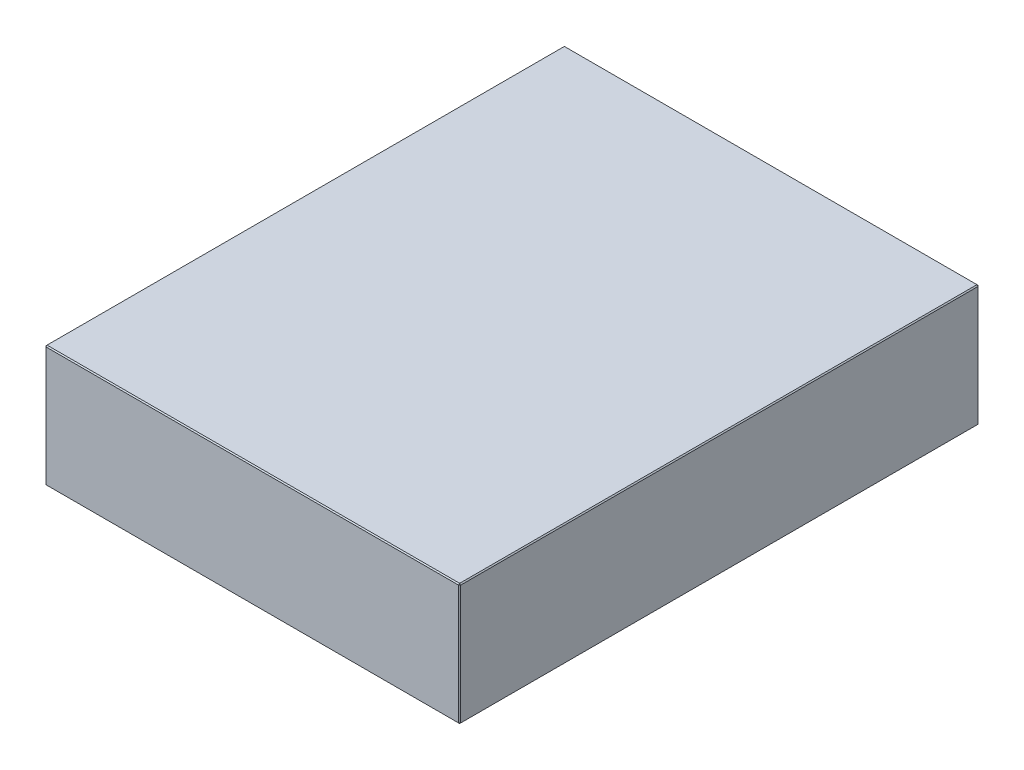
ISO-10303-21;
HEADER;
FILE_DESCRIPTION(('STEP AP214'),'2;1');
FILE_NAME('part.step','',(''),(''),'','','');
FILE_SCHEMA(('AUTOMOTIVE_DESIGN { 1 0 10303 214 1 1 1 1 }'));
ENDSEC;
DATA;
#1=APPLICATION_CONTEXT('core data for automotive mechanical design processes');
#2=APPLICATION_PROTOCOL_DEFINITION('international standard','automotive_design',2000,#1);
#3=PRODUCT_CONTEXT('',#1,'mechanical');
#4=PRODUCT('Part','Part','',(#3));
#5=PRODUCT_RELATED_PRODUCT_CATEGORY('part','',(#4));
#6=PRODUCT_DEFINITION_FORMATION('','',#4);
#7=PRODUCT_DEFINITION_CONTEXT('part definition',#1,'design');
#8=PRODUCT_DEFINITION('design','',#6,#7);
#9=PRODUCT_DEFINITION_SHAPE('','',#8);
#10=(LENGTH_UNIT() NAMED_UNIT(*) SI_UNIT(.MILLI.,.METRE.));
#11=(NAMED_UNIT(*) PLANE_ANGLE_UNIT() SI_UNIT($,.RADIAN.));
#12=(NAMED_UNIT(*) SI_UNIT($,.STERADIAN.) SOLID_ANGLE_UNIT());
#13=UNCERTAINTY_MEASURE_WITH_UNIT(LENGTH_MEASURE(1.E-05),#10,'distance_accuracy_value','');
#14=(GEOMETRIC_REPRESENTATION_CONTEXT(3) GLOBAL_UNCERTAINTY_ASSIGNED_CONTEXT((#13)) GLOBAL_UNIT_ASSIGNED_CONTEXT((#10,
#11,#12)) REPRESENTATION_CONTEXT('',''));
#15=CARTESIAN_POINT('',(0.,0.,0.));
#16=DIRECTION('',(0.,0.,1.));
#17=DIRECTION('',(1.,0.,0.));
#18=AXIS2_PLACEMENT_3D('',#15,#16,#17);
#19=CARTESIAN_POINT('',(-198.,116.,248.));
#20=DIRECTION('',(1.,0.,0.));
#21=DIRECTION('',(0.,0.,-1.));
#22=AXIS2_PLACEMENT_3D('',#19,#20,#21);
#23=PLANE('',#22);
#24=DIRECTION('',(0.,-1.,0.));
#25=VECTOR('',#24,1.);
#26=CARTESIAN_POINT('',(-198.,116.,-247.));
#27=LINE('',#26,#25);
#28=CARTESIAN_POINT('',(-198.,115.,-247.));
#29=VERTEX_POINT('',#28);
#30=CARTESIAN_POINT('',(-198.,1.00000000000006,-247.));
#31=VERTEX_POINT('',#30);
#32=EDGE_CURVE('E114',#29,#31,#27,.T.);
#33=ORIENTED_EDGE('',*,*,#32,.T.);
#34=DIRECTION('',(0.,0.,1.));
#35=VECTOR('',#34,1.);
#36=CARTESIAN_POINT('',(-198.,1.00000000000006,248.));
#37=LINE('',#36,#35);
#38=CARTESIAN_POINT('',(-198.,1.00000000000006,247.));
#39=VERTEX_POINT('',#38);
#40=EDGE_CURVE('E110',#31,#39,#37,.T.);
#41=ORIENTED_EDGE('',*,*,#40,.T.);
#42=DIRECTION('',(0.,1.,0.));
#43=VECTOR('',#42,1.);
#44=CARTESIAN_POINT('',(-198.,116.,247.));
#45=LINE('',#44,#43);
#46=CARTESIAN_POINT('',(-198.,115.,247.));
#47=VERTEX_POINT('',#46);
#48=EDGE_CURVE('E103',#39,#47,#45,.T.);
#49=ORIENTED_EDGE('',*,*,#48,.T.);
#50=DIRECTION('',(0.,0.,-1.));
#51=VECTOR('',#50,1.);
#52=CARTESIAN_POINT('',(-198.,115.,-248.));
#53=LINE('',#52,#51);
#54=EDGE_CURVE('E107',#47,#29,#53,.T.);
#55=ORIENTED_EDGE('',*,*,#54,.T.);
#56=EDGE_LOOP('',(#33,#41,#49,#55));
#57=FACE_BOUND('',#56,.T.);
#58=ADVANCED_FACE('F15',(#57),#23,.F.);
#59=CARTESIAN_POINT('',(198.,116.,248.));
#60=DIRECTION('',(0.,0.,-1.));
#61=DIRECTION('',(-1.,0.,0.));
#62=AXIS2_PLACEMENT_3D('',#59,#60,#61);
#63=PLANE('',#62);
#64=DIRECTION('',(-1.,0.,0.));
#65=VECTOR('',#64,1.);
#66=CARTESIAN_POINT('',(-198.,115.,248.));
#67=LINE('',#66,#65);
#68=CARTESIAN_POINT('',(197.,115.,248.));
#69=VERTEX_POINT('',#68);
#70=CARTESIAN_POINT('',(-197.,115.,248.));
#71=VERTEX_POINT('',#70);
#72=EDGE_CURVE('E164',#69,#71,#67,.T.);
#73=ORIENTED_EDGE('',*,*,#72,.T.);
#74=DIRECTION('',(0.,-1.,0.));
#75=VECTOR('',#74,1.);
#76=CARTESIAN_POINT('',(-197.,116.,248.));
#77=LINE('',#76,#75);
#78=CARTESIAN_POINT('',(-197.,1.00000000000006,248.));
#79=VERTEX_POINT('',#78);
#80=EDGE_CURVE('E122',#71,#79,#77,.T.);
#81=ORIENTED_EDGE('',*,*,#80,.T.);
#82=DIRECTION('',(1.,0.,0.));
#83=VECTOR('',#82,1.);
#84=CARTESIAN_POINT('',(198.,1.00000000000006,248.));
#85=LINE('',#84,#83);
#86=CARTESIAN_POINT('',(197.,1.00000000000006,248.));
#87=VERTEX_POINT('',#86);
#88=EDGE_CURVE('E168',#79,#87,#85,.T.);
#89=ORIENTED_EDGE('',*,*,#88,.T.);
#90=DIRECTION('',(0.,1.,0.));
#91=VECTOR('',#90,1.);
#92=CARTESIAN_POINT('',(197.,116.,248.));
#93=LINE('',#92,#91);
#94=EDGE_CURVE('E166',#87,#69,#93,.T.);
#95=ORIENTED_EDGE('',*,*,#94,.T.);
#96=EDGE_LOOP('',(#73,#81,#89,#95));
#97=FACE_BOUND('',#96,.T.);
#98=ADVANCED_FACE('F275',(#97),#63,.F.);
#99=CARTESIAN_POINT('',(198.,116.,248.));
#100=DIRECTION('',(-1.,0.,0.));
#101=DIRECTION('',(0.,0.,1.));
#102=AXIS2_PLACEMENT_3D('',#99,#100,#101);
#103=PLANE('',#102);
#104=DIRECTION('',(0.,0.,-1.));
#105=VECTOR('',#104,1.);
#106=CARTESIAN_POINT('',(198.,1.00000000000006,248.));
#107=LINE('',#106,#105);
#108=CARTESIAN_POINT('',(198.,1.00000000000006,247.));
#109=VERTEX_POINT('',#108);
#110=CARTESIAN_POINT('',(198.,1.00000000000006,-247.));
#111=VERTEX_POINT('',#110);
#112=EDGE_CURVE('E159',#109,#111,#107,.T.);
#113=ORIENTED_EDGE('',*,*,#112,.T.);
#114=DIRECTION('',(0.,1.,0.));
#115=VECTOR('',#114,1.);
#116=CARTESIAN_POINT('',(198.,116.,-247.));
#117=LINE('',#116,#115);
#118=CARTESIAN_POINT('',(198.,115.,-247.));
#119=VERTEX_POINT('',#118);
#120=EDGE_CURVE('E161',#111,#119,#117,.T.);
#121=ORIENTED_EDGE('',*,*,#120,.T.);
#122=DIRECTION('',(0.,0.,1.));
#123=VECTOR('',#122,1.);
#124=CARTESIAN_POINT('',(198.,115.,248.));
#125=LINE('',#124,#123);
#126=CARTESIAN_POINT('',(198.,115.,247.));
#127=VERTEX_POINT('',#126);
#128=EDGE_CURVE('E155',#119,#127,#125,.T.);
#129=ORIENTED_EDGE('',*,*,#128,.T.);
#130=DIRECTION('',(0.,-1.,0.));
#131=VECTOR('',#130,1.);
#132=CARTESIAN_POINT('',(198.,116.,247.));
#133=LINE('',#132,#131);
#134=EDGE_CURVE('E157',#127,#109,#133,.T.);
#135=ORIENTED_EDGE('',*,*,#134,.T.);
#136=EDGE_LOOP('',(#113,#121,#129,#135));
#137=FACE_BOUND('',#136,.T.);
#138=ADVANCED_FACE('F254',(#137),#103,.F.);
#139=CARTESIAN_POINT('',(198.,116.,-248.));
#140=DIRECTION('',(0.,0.,1.));
#141=DIRECTION('',(1.,0.,0.));
#142=AXIS2_PLACEMENT_3D('',#139,#140,#141);
#143=PLANE('',#142);
#144=DIRECTION('',(0.,-1.,0.));
#145=VECTOR('',#144,1.);
#146=CARTESIAN_POINT('',(197.,116.,-248.));
#147=LINE('',#146,#145);
#148=CARTESIAN_POINT('',(197.,115.,-248.));
#149=VERTEX_POINT('',#148);
#150=CARTESIAN_POINT('',(197.,1.00000000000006,-248.));
#151=VERTEX_POINT('',#150);
#152=EDGE_CURVE('E148',#149,#151,#147,.T.);
#153=ORIENTED_EDGE('',*,*,#152,.T.);
#154=DIRECTION('',(-1.,0.,0.));
#155=VECTOR('',#154,1.);
#156=CARTESIAN_POINT('',(198.,1.00000000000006,-248.));
#157=LINE('',#156,#155);
#158=CARTESIAN_POINT('',(-197.,1.00000000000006,-248.));
#159=VERTEX_POINT('',#158);
#160=EDGE_CURVE('E153',#151,#159,#157,.T.);
#161=ORIENTED_EDGE('',*,*,#160,.T.);
#162=DIRECTION('',(0.,1.,0.));
#163=VECTOR('',#162,1.);
#164=CARTESIAN_POINT('',(-197.,116.,-248.));
#165=LINE('',#164,#163);
#166=CARTESIAN_POINT('',(-197.,115.,-248.));
#167=VERTEX_POINT('',#166);
#168=EDGE_CURVE('E150',#159,#167,#165,.T.);
#169=ORIENTED_EDGE('',*,*,#168,.T.);
#170=DIRECTION('',(1.,0.,0.));
#171=VECTOR('',#170,1.);
#172=CARTESIAN_POINT('',(198.,115.,-248.));
#173=LINE('',#172,#171);
#174=EDGE_CURVE('E146',#167,#149,#173,.T.);
#175=ORIENTED_EDGE('',*,*,#174,.T.);
#176=EDGE_LOOP('',(#153,#161,#169,#175));
#177=FACE_BOUND('',#176,.T.);
#178=ADVANCED_FACE('F284',(#177),#143,.F.);
#179=CARTESIAN_POINT('',(0.,116.,0.));
#180=DIRECTION('',(0.,1.,0.));
#181=DIRECTION('',(0.,0.,1.));
#182=AXIS2_PLACEMENT_3D('',#179,#180,#181);
#183=PLANE('',#182);
#184=DIRECTION('',(0.,0.,-1.));
#185=VECTOR('',#184,1.);
#186=CARTESIAN_POINT('',(197.,116.,-248.));
#187=LINE('',#186,#185);
#188=CARTESIAN_POINT('',(197.,116.,247.));
#189=VERTEX_POINT('',#188);
#190=CARTESIAN_POINT('',(197.,116.,-247.));
#191=VERTEX_POINT('',#190);
#192=EDGE_CURVE('E24',#189,#191,#187,.T.);
#193=ORIENTED_EDGE('',*,*,#192,.T.);
#194=DIRECTION('',(-1.,0.,0.));
#195=VECTOR('',#194,1.);
#196=CARTESIAN_POINT('',(-198.,116.,-247.));
#197=LINE('',#196,#195);
#198=CARTESIAN_POINT('',(-197.,116.,-247.));
#199=VERTEX_POINT('',#198);
#200=EDGE_CURVE('E9',#191,#199,#197,.T.);
#201=ORIENTED_EDGE('',*,*,#200,.T.);
#202=DIRECTION('',(0.,0.,1.));
#203=VECTOR('',#202,1.);
#204=CARTESIAN_POINT('',(-197.,116.,248.));
#205=LINE('',#204,#203);
#206=CARTESIAN_POINT('',(-197.,116.,247.));
#207=VERTEX_POINT('',#206);
#208=EDGE_CURVE('E180',#199,#207,#205,.T.);
#209=ORIENTED_EDGE('',*,*,#208,.T.);
#210=DIRECTION('',(1.,0.,0.));
#211=VECTOR('',#210,1.);
#212=CARTESIAN_POINT('',(198.,116.,247.));
#213=LINE('',#212,#211);
#214=EDGE_CURVE('E35',#207,#189,#213,.T.);
#215=ORIENTED_EDGE('',*,*,#214,.T.);
#216=EDGE_LOOP('',(#193,#201,#209,#215));
#217=FACE_BOUND('',#216,.T.);
#218=ADVANCED_FACE('F350',(#217),#183,.T.);
#219=CARTESIAN_POINT('',(0.,0.,0.));
#220=DIRECTION('',(0.,1.,0.));
#221=DIRECTION('',(0.,0.,1.));
#222=AXIS2_PLACEMENT_3D('',#219,#220,#221);
#223=PLANE('',#222);
#224=DIRECTION('',(0.,0.,1.));
#225=VECTOR('',#224,1.);
#226=CARTESIAN_POINT('',(197.,0.,0.));
#227=LINE('',#226,#225);
#228=CARTESIAN_POINT('',(197.,0.,-247.));
#229=VERTEX_POINT('',#228);
#230=CARTESIAN_POINT('',(197.,0.,247.));
#231=VERTEX_POINT('',#230);
#232=EDGE_CURVE('E171',#229,#231,#227,.T.);
#233=ORIENTED_EDGE('',*,*,#232,.T.);
#234=DIRECTION('',(-1.,0.,0.));
#235=VECTOR('',#234,1.);
#236=CARTESIAN_POINT('',(0.,0.,247.));
#237=LINE('',#236,#235);
#238=CARTESIAN_POINT('',(-197.,0.,247.));
#239=VERTEX_POINT('',#238);
#240=EDGE_CURVE('E177',#231,#239,#237,.T.);
#241=ORIENTED_EDGE('',*,*,#240,.T.);
#242=DIRECTION('',(0.,0.,-1.));
#243=VECTOR('',#242,1.);
#244=CARTESIAN_POINT('',(-197.,0.,0.));
#245=LINE('',#244,#243);
#246=CARTESIAN_POINT('',(-197.,0.,-247.));
#247=VERTEX_POINT('',#246);
#248=EDGE_CURVE('E175',#239,#247,#245,.T.);
#249=ORIENTED_EDGE('',*,*,#248,.T.);
#250=DIRECTION('',(1.,0.,0.));
#251=VECTOR('',#250,1.);
#252=CARTESIAN_POINT('',(0.,0.,-247.));
#253=LINE('',#252,#251);
#254=EDGE_CURVE('E173',#247,#229,#253,.T.);
#255=ORIENTED_EDGE('',*,*,#254,.T.);
#256=EDGE_LOOP('',(#233,#241,#249,#255));
#257=FACE_BOUND('',#256,.T.);
#258=ADVANCED_FACE('F246',(#257),#223,.F.);
#259=CARTESIAN_POINT('',(198.,116.,247.));
#260=DIRECTION('',(-0.707106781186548,0.,-0.707106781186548));
#261=DIRECTION('',(0.,-1.,0.));
#262=AXIS2_PLACEMENT_3D('',#259,#260,#261);
#263=PLANE('',#262);
#264=DIRECTION('',(-0.707106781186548,0.,0.707106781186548));
#265=VECTOR('',#264,1.);
#266=CARTESIAN_POINT('',(197.,115.,248.));
#267=LINE('',#266,#265);
#268=EDGE_CURVE('E19',#69,#127,#267,.F.);
#269=ORIENTED_EDGE('',*,*,#268,.F.);
#270=ORIENTED_EDGE('',*,*,#94,.F.);
#271=DIRECTION('',(0.707106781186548,0.,-0.707106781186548));
#272=VECTOR('',#271,1.);
#273=CARTESIAN_POINT('',(197.,1.00000000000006,248.));
#274=LINE('',#273,#272);
#275=EDGE_CURVE('E142',#109,#87,#274,.F.);
#276=ORIENTED_EDGE('',*,*,#275,.F.);
#277=ORIENTED_EDGE('',*,*,#134,.F.);
#278=EDGE_LOOP('',(#269,#270,#276,#277));
#279=FACE_BOUND('',#278,.T.);
#280=ADVANCED_FACE('F17',(#279),#263,.F.);
#281=CARTESIAN_POINT('',(197.,115.,248.));
#282=DIRECTION('',(0.577350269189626,0.577350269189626,0.577350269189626));
#283=DIRECTION('',(0.707106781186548,0.,-0.707106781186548));
#284=AXIS2_PLACEMENT_3D('',#281,#282,#283);
#285=PLANE('',#284);
#286=DIRECTION('',(0.,-0.707106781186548,0.707106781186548));
#287=VECTOR('',#286,1.);
#288=CARTESIAN_POINT('',(197.,115.,248.));
#289=LINE('',#288,#287);
#290=EDGE_CURVE('E226',#69,#189,#289,.F.);
#291=ORIENTED_EDGE('',*,*,#290,.F.);
#292=ORIENTED_EDGE('',*,*,#268,.T.);
#293=DIRECTION('',(-0.707106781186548,0.707106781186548,0.));
#294=VECTOR('',#293,1.);
#295=CARTESIAN_POINT('',(197.5,115.5,247.));
#296=LINE('',#295,#294);
#297=EDGE_CURVE('E228',#189,#127,#296,.F.);
#298=ORIENTED_EDGE('',*,*,#297,.F.);
#299=EDGE_LOOP('',(#291,#292,#298));
#300=FACE_BOUND('',#299,.T.);
#301=ADVANCED_FACE('F270',(#300),#285,.T.);
#302=CARTESIAN_POINT('',(197.,1.00000000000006,248.));
#303=DIRECTION('',(0.577350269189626,-0.577350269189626,0.577350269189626));
#304=DIRECTION('',(0.707106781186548,0.,-0.707106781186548));
#305=AXIS2_PLACEMENT_3D('',#302,#303,#304);
#306=PLANE('',#305);
#307=DIRECTION('',(-0.707106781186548,-0.707106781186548,0.));
#308=VECTOR('',#307,1.);
#309=CARTESIAN_POINT('',(197.5,0.500000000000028,247.));
#310=LINE('',#309,#308);
#311=EDGE_CURVE('E220',#109,#231,#310,.T.);
#312=ORIENTED_EDGE('',*,*,#311,.F.);
#313=ORIENTED_EDGE('',*,*,#275,.T.);
#314=DIRECTION('',(0.,0.707106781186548,0.707106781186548));
#315=VECTOR('',#314,1.);
#316=CARTESIAN_POINT('',(197.,1.00000000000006,248.));
#317=LINE('',#316,#315);
#318=EDGE_CURVE('E223',#231,#87,#317,.T.);
#319=ORIENTED_EDGE('',*,*,#318,.F.);
#320=EDGE_LOOP('',(#312,#313,#319));
#321=FACE_BOUND('',#320,.T.);
#322=ADVANCED_FACE('F235',(#321),#306,.T.);
#323=CARTESIAN_POINT('',(197.,116.,0.));
#324=DIRECTION('',(0.707106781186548,0.707106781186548,0.));
#325=DIRECTION('',(0.,0.,1.));
#326=AXIS2_PLACEMENT_3D('',#323,#324,#325);
#327=PLANE('',#326);
#328=ORIENTED_EDGE('',*,*,#297,.T.);
#329=ORIENTED_EDGE('',*,*,#128,.F.);
#330=DIRECTION('',(0.707106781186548,-0.707106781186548,0.));
#331=VECTOR('',#330,1.);
#332=CARTESIAN_POINT('',(198.,115.,-247.));
#333=LINE('',#332,#331);
#334=EDGE_CURVE('E215',#191,#119,#333,.T.);
#335=ORIENTED_EDGE('',*,*,#334,.F.);
#336=ORIENTED_EDGE('',*,*,#192,.F.);
#337=EDGE_LOOP('',(#328,#329,#335,#336));
#338=FACE_BOUND('',#337,.T.);
#339=ADVANCED_FACE('F265',(#338),#327,.T.);
#340=CARTESIAN_POINT('',(0.,116.,247.));
#341=DIRECTION('',(0.,0.707106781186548,0.707106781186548));
#342=DIRECTION('',(-1.,0.,0.));
#343=AXIS2_PLACEMENT_3D('',#340,#341,#342);
#344=PLANE('',#343);
#345=ORIENTED_EDGE('',*,*,#290,.T.);
#346=ORIENTED_EDGE('',*,*,#214,.F.);
#347=DIRECTION('',(0.,0.707106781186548,-0.707106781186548));
#348=VECTOR('',#347,1.);
#349=CARTESIAN_POINT('',(-197.,115.5,247.5));
#350=LINE('',#349,#348);
#351=EDGE_CURVE('E126',#71,#207,#350,.T.);
#352=ORIENTED_EDGE('',*,*,#351,.F.);
#353=ORIENTED_EDGE('',*,*,#72,.F.);
#354=EDGE_LOOP('',(#345,#346,#352,#353));
#355=FACE_BOUND('',#354,.T.);
#356=ADVANCED_FACE('F273',(#355),#344,.T.);
#357=CARTESIAN_POINT('',(-197.,116.,248.));
#358=DIRECTION('',(0.707106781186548,0.,-0.707106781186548));
#359=DIRECTION('',(0.,-1.,0.));
#360=AXIS2_PLACEMENT_3D('',#357,#358,#359);
#361=PLANE('',#360);
#362=DIRECTION('',(0.707106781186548,0.,0.707106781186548));
#363=VECTOR('',#362,1.);
#364=CARTESIAN_POINT('',(-197.,1.00000000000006,248.));
#365=LINE('',#364,#363);
#366=EDGE_CURVE('E127',#79,#39,#365,.F.);
#367=ORIENTED_EDGE('',*,*,#366,.F.);
#368=ORIENTED_EDGE('',*,*,#80,.F.);
#369=DIRECTION('',(-0.707106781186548,0.,-0.707106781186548));
#370=VECTOR('',#369,1.);
#371=CARTESIAN_POINT('',(-198.,115.,247.));
#372=LINE('',#371,#370);
#373=EDGE_CURVE('E118',#47,#71,#372,.F.);
#374=ORIENTED_EDGE('',*,*,#373,.F.);
#375=ORIENTED_EDGE('',*,*,#48,.F.);
#376=EDGE_LOOP('',(#367,#368,#374,#375));
#377=FACE_BOUND('',#376,.T.);
#378=ADVANCED_FACE('F120',(#377),#361,.F.);
#379=CARTESIAN_POINT('',(198.,1.00000000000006,248.));
#380=DIRECTION('',(0.,0.707106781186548,-0.707106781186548));
#381=DIRECTION('',(1.,0.,0.));
#382=AXIS2_PLACEMENT_3D('',#379,#380,#381);
#383=PLANE('',#382);
#384=ORIENTED_EDGE('',*,*,#318,.T.);
#385=ORIENTED_EDGE('',*,*,#88,.F.);
#386=DIRECTION('',(0.,-0.707106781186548,-0.707106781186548));
#387=VECTOR('',#386,1.);
#388=CARTESIAN_POINT('',(-197.,1.00000000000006,248.));
#389=LINE('',#388,#387);
#390=EDGE_CURVE('E211',#239,#79,#389,.F.);
#391=ORIENTED_EDGE('',*,*,#390,.F.);
#392=ORIENTED_EDGE('',*,*,#240,.F.);
#393=EDGE_LOOP('',(#384,#385,#391,#392));
#394=FACE_BOUND('',#393,.T.);
#395=ADVANCED_FACE('F243',(#394),#383,.F.);
#396=CARTESIAN_POINT('',(198.,1.00000000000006,248.));
#397=DIRECTION('',(-0.707106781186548,0.707106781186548,0.));
#398=DIRECTION('',(0.,0.,-1.));
#399=AXIS2_PLACEMENT_3D('',#396,#397,#398);
#400=PLANE('',#399);
#401=ORIENTED_EDGE('',*,*,#311,.T.);
#402=ORIENTED_EDGE('',*,*,#232,.F.);
#403=DIRECTION('',(0.707106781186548,0.707106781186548,0.));
#404=VECTOR('',#403,1.);
#405=CARTESIAN_POINT('',(197.5,0.500000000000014,-247.));
#406=LINE('',#405,#404);
#407=EDGE_CURVE('E208',#111,#229,#406,.F.);
#408=ORIENTED_EDGE('',*,*,#407,.F.);
#409=ORIENTED_EDGE('',*,*,#112,.F.);
#410=EDGE_LOOP('',(#401,#402,#408,#409));
#411=FACE_BOUND('',#410,.T.);
#412=ADVANCED_FACE('F251',(#411),#400,.F.);
#413=CARTESIAN_POINT('',(197.,116.,-248.));
#414=DIRECTION('',(-0.707106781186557,0.,0.707106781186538));
#415=DIRECTION('',(0.,-1.,0.));
#416=AXIS2_PLACEMENT_3D('',#413,#414,#415);
#417=PLANE('',#416);
#418=DIRECTION('',(0.707106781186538,0.,0.707106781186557));
#419=VECTOR('',#418,1.);
#420=CARTESIAN_POINT('',(198.,115.,-247.));
#421=LINE('',#420,#419);
#422=EDGE_CURVE('E217',#119,#149,#421,.F.);
#423=ORIENTED_EDGE('',*,*,#422,.F.);
#424=ORIENTED_EDGE('',*,*,#120,.F.);
#425=DIRECTION('',(-0.707106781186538,0.,-0.707106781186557));
#426=VECTOR('',#425,1.);
#427=CARTESIAN_POINT('',(197.,1.00000000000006,-248.));
#428=LINE('',#427,#426);
#429=EDGE_CURVE('E205',#151,#111,#428,.F.);
#430=ORIENTED_EDGE('',*,*,#429,.F.);
#431=ORIENTED_EDGE('',*,*,#152,.F.);
#432=EDGE_LOOP('',(#423,#424,#430,#431));
#433=FACE_BOUND('',#432,.T.);
#434=ADVANCED_FACE('F258',(#433),#417,.F.);
#435=CARTESIAN_POINT('',(198.,115.,-247.));
#436=DIRECTION('',(0.577350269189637,0.57735026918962,-0.57735026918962));
#437=DIRECTION('',(-0.707106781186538,0.,-0.707106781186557));
#438=AXIS2_PLACEMENT_3D('',#435,#436,#437);
#439=PLANE('',#438);
#440=ORIENTED_EDGE('',*,*,#334,.T.);
#441=ORIENTED_EDGE('',*,*,#422,.T.);
#442=DIRECTION('',(0.,0.707106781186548,0.707106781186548));
#443=VECTOR('',#442,1.);
#444=CARTESIAN_POINT('',(197.,115.5,-247.5));
#445=LINE('',#444,#443);
#446=EDGE_CURVE('E134',#191,#149,#445,.F.);
#447=ORIENTED_EDGE('',*,*,#446,.F.);
#448=EDGE_LOOP('',(#440,#441,#447));
#449=FACE_BOUND('',#448,.T.);
#450=ADVANCED_FACE('F325',(#449),#439,.T.);
#451=CARTESIAN_POINT('',(-198.,115.,247.));
#452=DIRECTION('',(-0.577350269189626,0.577350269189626,0.577350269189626));
#453=DIRECTION('',(0.707106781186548,0.,0.707106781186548));
#454=AXIS2_PLACEMENT_3D('',#451,#452,#453);
#455=PLANE('',#454);
#456=ORIENTED_EDGE('',*,*,#373,.T.);
#457=ORIENTED_EDGE('',*,*,#351,.T.);
#458=DIRECTION('',(-0.707106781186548,-0.707106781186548,0.));
#459=VECTOR('',#458,1.);
#460=CARTESIAN_POINT('',(-198.,115.,247.));
#461=LINE('',#460,#459);
#462=EDGE_CURVE('E130',#47,#207,#461,.F.);
#463=ORIENTED_EDGE('',*,*,#462,.F.);
#464=EDGE_LOOP('',(#456,#457,#463));
#465=FACE_BOUND('',#464,.T.);
#466=ADVANCED_FACE('F131',(#465),#455,.T.);
#467=CARTESIAN_POINT('',(-197.,1.00000000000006,248.));
#468=DIRECTION('',(-0.577350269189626,-0.577350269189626,0.577350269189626));
#469=DIRECTION('',(0.707106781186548,0.,0.707106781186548));
#470=AXIS2_PLACEMENT_3D('',#467,#468,#469);
#471=PLANE('',#470);
#472=ORIENTED_EDGE('',*,*,#390,.T.);
#473=ORIENTED_EDGE('',*,*,#366,.T.);
#474=DIRECTION('',(-0.707106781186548,0.707106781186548,0.));
#475=VECTOR('',#474,1.);
#476=CARTESIAN_POINT('',(-197.5,0.500000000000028,247.));
#477=LINE('',#476,#475);
#478=EDGE_CURVE('E135',#239,#39,#477,.T.);
#479=ORIENTED_EDGE('',*,*,#478,.F.);
#480=EDGE_LOOP('',(#472,#473,#479));
#481=FACE_BOUND('',#480,.T.);
#482=ADVANCED_FACE('F318',(#481),#471,.T.);
#483=CARTESIAN_POINT('',(197.,1.00000000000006,-248.));
#484=DIRECTION('',(0.577350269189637,-0.57735026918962,-0.57735026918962));
#485=DIRECTION('',(-0.707106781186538,0.,-0.707106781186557));
#486=AXIS2_PLACEMENT_3D('',#483,#484,#485);
#487=PLANE('',#486);
#488=ORIENTED_EDGE('',*,*,#429,.T.);
#489=ORIENTED_EDGE('',*,*,#407,.T.);
#490=DIRECTION('',(0.,-0.707106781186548,0.707106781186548));
#491=VECTOR('',#490,1.);
#492=CARTESIAN_POINT('',(197.,1.00000000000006,-248.));
#493=LINE('',#492,#491);
#494=EDGE_CURVE('E198',#151,#229,#493,.T.);
#495=ORIENTED_EDGE('',*,*,#494,.F.);
#496=EDGE_LOOP('',(#488,#489,#495));
#497=FACE_BOUND('',#496,.T.);
#498=ADVANCED_FACE('F314',(#497),#487,.T.);
#499=CARTESIAN_POINT('',(0.,116.,-247.));
#500=DIRECTION('',(0.,0.707106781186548,-0.707106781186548));
#501=DIRECTION('',(1.,0.,0.));
#502=AXIS2_PLACEMENT_3D('',#499,#500,#501);
#503=PLANE('',#502);
#504=ORIENTED_EDGE('',*,*,#446,.T.);
#505=ORIENTED_EDGE('',*,*,#174,.F.);
#506=DIRECTION('',(0.,-0.707106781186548,-0.707106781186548));
#507=VECTOR('',#506,1.);
#508=CARTESIAN_POINT('',(-197.,115.,-248.));
#509=LINE('',#508,#507);
#510=EDGE_CURVE('E195',#199,#167,#509,.T.);
#511=ORIENTED_EDGE('',*,*,#510,.F.);
#512=ORIENTED_EDGE('',*,*,#200,.F.);
#513=EDGE_LOOP('',(#504,#505,#511,#512));
#514=FACE_BOUND('',#513,.T.);
#515=ADVANCED_FACE('F311',(#514),#503,.T.);
#516=CARTESIAN_POINT('',(-197.,116.,0.));
#517=DIRECTION('',(-0.707106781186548,0.707106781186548,0.));
#518=DIRECTION('',(0.,0.,-1.));
#519=AXIS2_PLACEMENT_3D('',#516,#517,#518);
#520=PLANE('',#519);
#521=ORIENTED_EDGE('',*,*,#462,.T.);
#522=ORIENTED_EDGE('',*,*,#208,.F.);
#523=DIRECTION('',(0.707106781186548,0.707106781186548,0.));
#524=VECTOR('',#523,1.);
#525=CARTESIAN_POINT('',(-197.5,115.5,-247.));
#526=LINE('',#525,#524);
#527=EDGE_CURVE('E138',#29,#199,#526,.T.);
#528=ORIENTED_EDGE('',*,*,#527,.F.);
#529=ORIENTED_EDGE('',*,*,#54,.F.);
#530=EDGE_LOOP('',(#521,#522,#528,#529));
#531=FACE_BOUND('',#530,.T.);
#532=ADVANCED_FACE('F137',(#531),#520,.T.);
#533=CARTESIAN_POINT('',(-198.,1.00000000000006,248.));
#534=DIRECTION('',(0.707106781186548,0.707106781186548,0.));
#535=DIRECTION('',(0.,0.,1.));
#536=AXIS2_PLACEMENT_3D('',#533,#534,#535);
#537=PLANE('',#536);
#538=ORIENTED_EDGE('',*,*,#478,.T.);
#539=ORIENTED_EDGE('',*,*,#40,.F.);
#540=DIRECTION('',(0.707106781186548,-0.707106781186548,0.));
#541=VECTOR('',#540,1.);
#542=CARTESIAN_POINT('',(-198.,1.00000000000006,-247.));
#543=LINE('',#542,#541);
#544=EDGE_CURVE('E191',#247,#31,#543,.F.);
#545=ORIENTED_EDGE('',*,*,#544,.F.);
#546=ORIENTED_EDGE('',*,*,#248,.F.);
#547=EDGE_LOOP('',(#538,#539,#545,#546));
#548=FACE_BOUND('',#547,.T.);
#549=ADVANCED_FACE('F304',(#548),#537,.F.);
#550=CARTESIAN_POINT('',(198.,1.00000000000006,-248.));
#551=DIRECTION('',(0.,0.707106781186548,0.707106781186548));
#552=DIRECTION('',(-1.,0.,0.));
#553=AXIS2_PLACEMENT_3D('',#550,#551,#552);
#554=PLANE('',#553);
#555=ORIENTED_EDGE('',*,*,#494,.T.);
#556=ORIENTED_EDGE('',*,*,#254,.F.);
#557=DIRECTION('',(0.,0.707106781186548,-0.707106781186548));
#558=VECTOR('',#557,1.);
#559=CARTESIAN_POINT('',(-197.,0.500000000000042,-247.5));
#560=LINE('',#559,#558);
#561=EDGE_CURVE('E188',#159,#247,#560,.F.);
#562=ORIENTED_EDGE('',*,*,#561,.F.);
#563=ORIENTED_EDGE('',*,*,#160,.F.);
#564=EDGE_LOOP('',(#555,#556,#562,#563));
#565=FACE_BOUND('',#564,.T.);
#566=ADVANCED_FACE('F300',(#565),#554,.F.);
#567=CARTESIAN_POINT('',(-197.,115.,-248.));
#568=DIRECTION('',(-0.577350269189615,0.577350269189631,-0.577350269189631));
#569=DIRECTION('',(0.,0.707106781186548,0.707106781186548));
#570=AXIS2_PLACEMENT_3D('',#567,#568,#569);
#571=PLANE('',#570);
#572=ORIENTED_EDGE('',*,*,#527,.T.);
#573=ORIENTED_EDGE('',*,*,#510,.T.);
#574=DIRECTION('',(0.707106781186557,0.,-0.707106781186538));
#575=VECTOR('',#574,1.);
#576=CARTESIAN_POINT('',(-197.,115.,-248.));
#577=LINE('',#576,#575);
#578=EDGE_CURVE('E186',#29,#167,#577,.T.);
#579=ORIENTED_EDGE('',*,*,#578,.F.);
#580=EDGE_LOOP('',(#572,#573,#579));
#581=FACE_BOUND('',#580,.T.);
#582=ADVANCED_FACE('F296',(#581),#571,.T.);
#583=CARTESIAN_POINT('',(-198.,1.00000000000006,-247.));
#584=DIRECTION('',(-0.577350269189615,-0.577350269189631,-0.577350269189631));
#585=DIRECTION('',(0.,0.707106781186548,-0.707106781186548));
#586=AXIS2_PLACEMENT_3D('',#583,#584,#585);
#587=PLANE('',#586);
#588=ORIENTED_EDGE('',*,*,#561,.T.);
#589=ORIENTED_EDGE('',*,*,#544,.T.);
#590=DIRECTION('',(-0.707106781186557,0.,0.707106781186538));
#591=VECTOR('',#590,1.);
#592=CARTESIAN_POINT('',(-198.,1.00000000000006,-247.));
#593=LINE('',#592,#591);
#594=EDGE_CURVE('E184',#159,#31,#593,.T.);
#595=ORIENTED_EDGE('',*,*,#594,.F.);
#596=EDGE_LOOP('',(#588,#589,#595));
#597=FACE_BOUND('',#596,.T.);
#598=ADVANCED_FACE('F292',(#597),#587,.T.);
#599=CARTESIAN_POINT('',(-198.,116.,-247.));
#600=DIRECTION('',(0.707106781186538,0.,0.707106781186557));
#601=DIRECTION('',(0.,-1.,0.));
#602=AXIS2_PLACEMENT_3D('',#599,#600,#601);
#603=PLANE('',#602);
#604=ORIENTED_EDGE('',*,*,#578,.T.);
#605=ORIENTED_EDGE('',*,*,#168,.F.);
#606=ORIENTED_EDGE('',*,*,#594,.T.);
#607=ORIENTED_EDGE('',*,*,#32,.F.);
#608=EDGE_LOOP('',(#604,#605,#606,#607));
#609=FACE_BOUND('',#608,.T.);
#610=ADVANCED_FACE('F289',(#609),#603,.F.);
#611=CLOSED_SHELL('',(#58,#98,#138,#178,#218,#258,#280,#301,#322,#339,#356,#378,#395,#412,#434,
#450,#466,#482,#498,#515,#532,#549,#566,#582,#598,#610));
#612=MANIFOLD_SOLID_BREP('B1',#611);
#613=ADVANCED_BREP_SHAPE_REPRESENTATION('',(#18,#612),#14);
#614=SHAPE_DEFINITION_REPRESENTATION(#9,#613);
ENDSEC;
END-ISO-10303-21;
